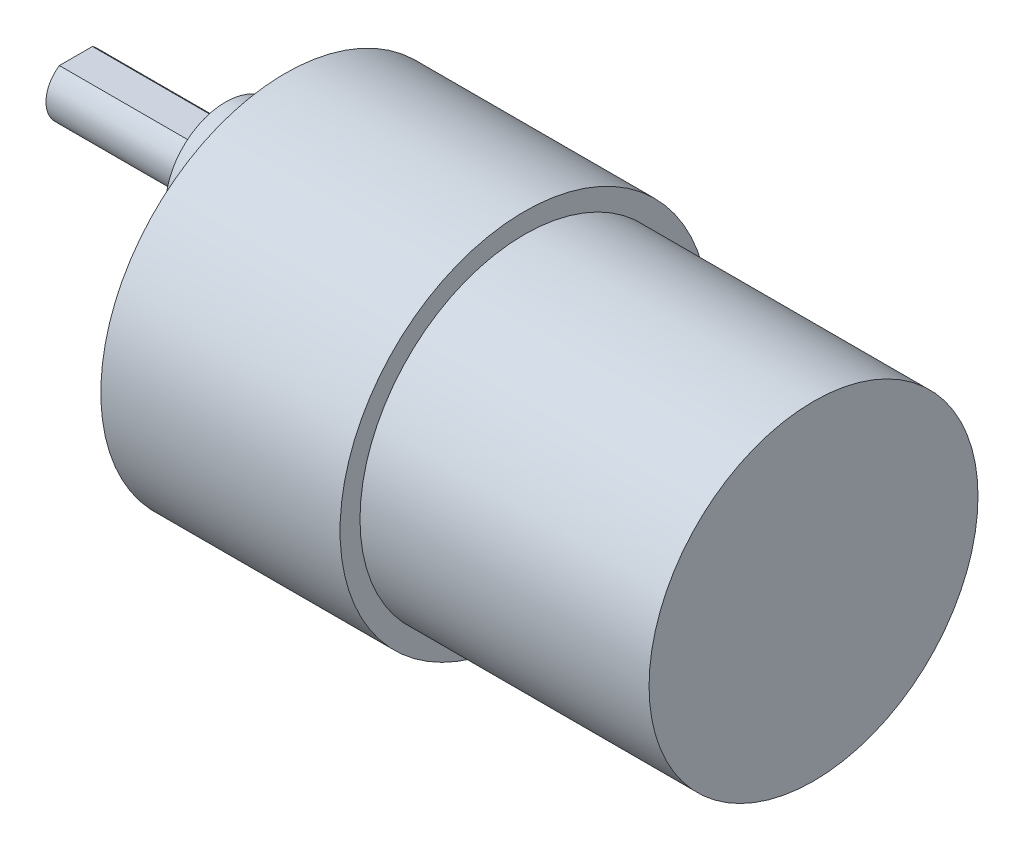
from build123d import *

# Parameters (mm, degrees)
SKETCH1_R                 = 18.5
MAIN_HEAD_DEPTH           = 24
SKETCH2_R                 = 6
BOSS_EXTRUDE2_DEPTH       = 6
MOTORSHAFT_DEPTH          = 15
SKETCH4_R                 = 16.5
BACK_PART_DEPTH           = 29
F_3_0MM_DOWEL_HOLE1_D     = 3
F_3_0MM_DOWEL_HOLE1_DEPTH = 9.05
F_3_0MM_DOWEL_HOLE1_TIP   = 0.901290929


with BuildPart() as part:
    # Sketch1 → main head (new body)
    with BuildSketch(Plane(origin=(0, 0, 0), x_dir=(0, 0, -1), z_dir=(1, 0, 0))):
        Circle(SKETCH1_R)
    extrude(amount=MAIN_HEAD_DEPTH)

    # Sketch2 → Boss-Extrude2 (add)
    with BuildSketch(Plane.ZY):
        with Locations(Location((0, 7, 0), (0, 0, 180))):
            Circle(SKETCH2_R)
    extrude(amount=BOSS_EXTRUDE2_DEPTH)

    # Sketch3 → motorshaft (add)
    with BuildSketch(Plane.ZY.offset(6)):
        with BuildLine():
            Line((-1.658312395, 9.5), (1.658312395, 9.5))
            ThreePointArc((1.658312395, 9.5), (0, 4), (-1.658312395, 9.5))
        make_face()
    extrude(amount=MOTORSHAFT_DEPTH)

    # Sketch4 → back part (add)
    with BuildSketch(Plane(origin=(24, 0, 0), x_dir=(0, 0, -1), z_dir=(1, 0, 0))):
        with Locations(Location((0, 0, 0), (0, 0, 180))):
            Circle(SKETCH4_R)
    extrude(amount=BACK_PART_DEPTH)

    # 3.0mm Dowel Hole1
    with Locations(Plane.ZY):
        with Locations((-15.5, 0), (-7.75, 13.423393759), (7.75, 13.423393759), (15.5, 0), (7.75, -13.423393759), (-7.75, -13.423393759)):
            Hole(F_3_0MM_DOWEL_HOLE1_D / 2, depth=F_3_0MM_DOWEL_HOLE1_DEPTH)
            with Locations((0, 0, -(F_3_0MM_DOWEL_HOLE1_DEPTH + F_3_0MM_DOWEL_HOLE1_TIP / 2))):  # 118° drill point
                Cone(0, F_3_0MM_DOWEL_HOLE1_D / 2, F_3_0MM_DOWEL_HOLE1_TIP, mode=Mode.SUBTRACT)


solid = part.part
